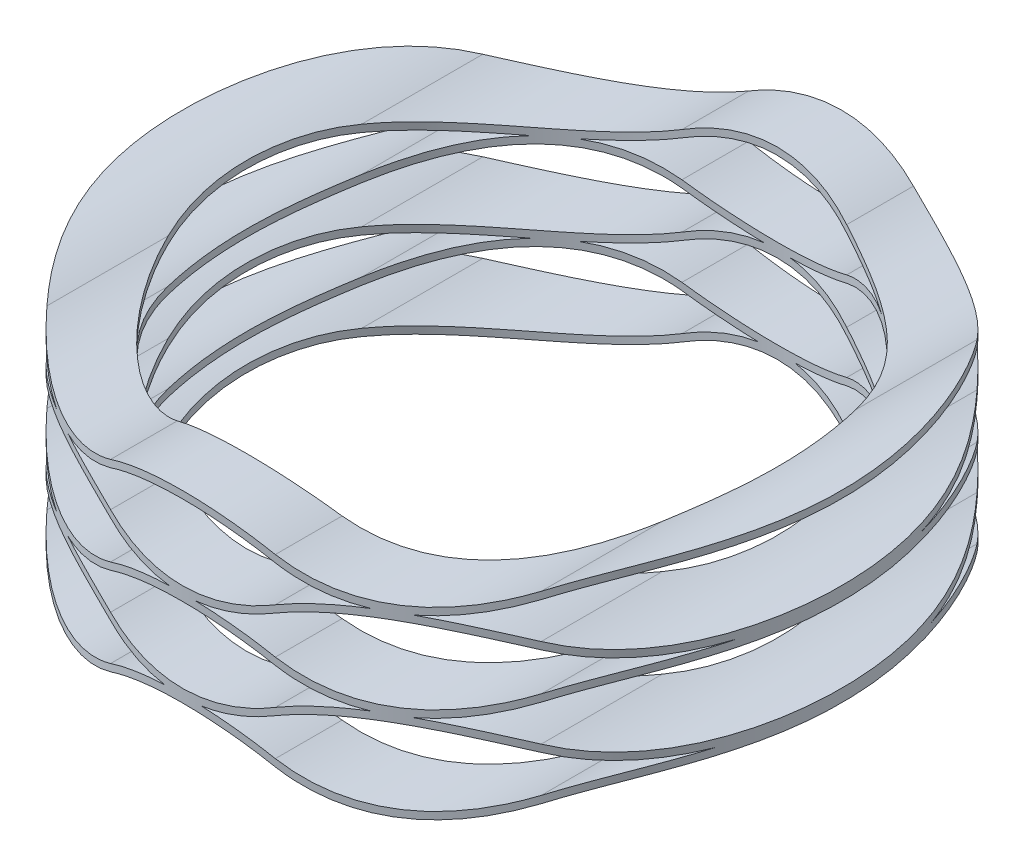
from build123d import *

# Parameters (mm, degrees)
BOSS_EXTRUDE1_DEPTH      = 11.1252
BOSS_EXTRUDE1_DEPTH_BACK = 11.1252
BOSS_EXTRUDE2_DEPTH      = 11.1252
BOSS_EXTRUDE2_DEPTH_BACK = 11.1252
BOSS_EXTRUDE3_DEPTH      = 11.1252
BOSS_EXTRUDE3_DEPTH_BACK = 11.1252
BOSS_EXTRUDE4_DEPTH      = 11.1252
BOSS_EXTRUDE4_DEPTH_BACK = 11.1252
BOSS_EXTRUDE5_DEPTH      = 11.1252
BOSS_EXTRUDE5_DEPTH_BACK = 11.1252
SKETCH6_W                = 37.084
SKETCH6_H                = 37.084
SKETCH6_R                = 9.271
CUT_EXTRUDE1_DEPTH       = 6.2484
SKETCH7_R                = 7.4676
CUT_EXTRUDE2_DEPTH       = 6.2484


with BuildPart() as part:
    # Sketch1 → Boss-Extrude1 (new, two sides: drawn at the far end of the back side and taken through both)
    with BuildSketch(Plane.XY.offset(-BOSS_EXTRUDE1_DEPTH_BACK)):
        with BuildLine():
            Line((11.58875, 0.52324), (11.58875, 0.72644))
            ThreePointArc((11.58875, 0.72644), (9.271, 1.27508), (6.95325, 0.72644))
            ThreePointArc((6.95325, 0.72644), (4.6355, 0.2032), (2.31775, 0.72644))
            ThreePointArc((2.31775, 0.72644), (0, 1.27508), (-2.31775, 0.72644))
            ThreePointArc((-2.31775, 0.72644), (-4.6355, 0.2032), (-6.95325, 0.72644))
            ThreePointArc((-6.95325, 0.72644), (-9.271, 1.27508), (-11.58875, 0.72644))
            Line((-11.58875, 0.72644), (-11.58875, 0.52324))
            ThreePointArc((-11.58875, 0.52324), (-9.271, 1.07188), (-6.95325, 0.52324))
            ThreePointArc((-6.95325, 0.52324), (-4.6355, 0), (-2.31775, 0.52324))
            ThreePointArc((-2.31775, 0.52324), (0, 1.07188), (2.31775, 0.52324))
            ThreePointArc((2.31775, 0.52324), (4.6355, 0), (6.95325, 0.52324))
            ThreePointArc((6.95325, 0.52324), (9.271, 1.07188), (11.58875, 0.52324))
        make_face()
    extrude(amount=BOSS_EXTRUDE1_DEPTH + BOSS_EXTRUDE1_DEPTH_BACK)

    # Sketch2 → Boss-Extrude2 (add, two sides: drawn at the far end of the back side and taken through both)
    with BuildSketch(Plane.XY.offset(-BOSS_EXTRUDE2_DEPTH_BACK)):
        with BuildLine():
            Line((-11.58875, 1.97612), (-11.58875, 1.77292))
            ThreePointArc((-11.58875, 1.77292), (-9.271, 1.22428), (-6.95325, 1.77292))
            ThreePointArc((-6.95325, 1.77292), (-4.6355, 2.29616), (-2.31775, 1.77292))
            ThreePointArc((-2.31775, 1.77292), (0, 1.22428), (2.31775, 1.77292))
            ThreePointArc((2.31775, 1.77292), (4.6355, 2.29616), (6.95325, 1.77292))
            ThreePointArc((6.95325, 1.77292), (9.271, 1.22428), (11.58875, 1.77292))
            Line((11.58875, 1.77292), (11.58875, 1.97612))
            ThreePointArc((11.58875, 1.97612), (9.271, 1.42748), (6.95325, 1.97612))
            ThreePointArc((6.95325, 1.97612), (4.6355, 2.49936), (2.31775, 1.97612))
            ThreePointArc((2.31775, 1.97612), (0, 1.42748), (-2.31775, 1.97612))
            ThreePointArc((-2.31775, 1.97612), (-4.6355, 2.49936), (-6.95325, 1.97612))
            ThreePointArc((-6.95325, 1.97612), (-9.271, 1.42748), (-11.58875, 1.97612))
        make_face()
    extrude(amount=BOSS_EXTRUDE2_DEPTH + BOSS_EXTRUDE2_DEPTH_BACK)

    # Sketch3 → Boss-Extrude3 (add, two sides: drawn at the far end of the back side and taken through both)
    with BuildSketch(Plane.XY.offset(-BOSS_EXTRUDE3_DEPTH_BACK)):
        with BuildLine():
            Line((11.58875, 2.9972), (11.58875, 3.2004))
            ThreePointArc((11.58875, 3.2004), (9.271, 3.74904), (6.95325, 3.2004))
            ThreePointArc((6.95325, 3.2004), (4.6355, 2.67716), (2.31775, 3.2004))
            ThreePointArc((2.31775, 3.2004), (0, 3.74904), (-2.31775, 3.2004))
            ThreePointArc((-2.31775, 3.2004), (-4.6355, 2.67716), (-6.95325, 3.2004))
            ThreePointArc((-6.95325, 3.2004), (-9.271, 3.74904), (-11.58875, 3.2004))
            Line((-11.58875, 3.2004), (-11.58875, 2.9972))
            ThreePointArc((-11.58875, 2.9972), (-9.271, 3.54584), (-6.95325, 2.9972))
            ThreePointArc((-6.95325, 2.9972), (-4.6355, 2.47396), (-2.31775, 2.9972))
            ThreePointArc((-2.31775, 2.9972), (0, 3.54584), (2.31775, 2.9972))
            ThreePointArc((2.31775, 2.9972), (4.6355, 2.47396), (6.95325, 2.9972))
            ThreePointArc((6.95325, 2.9972), (9.271, 3.54584), (11.58875, 2.9972))
        make_face()
    extrude(amount=BOSS_EXTRUDE3_DEPTH + BOSS_EXTRUDE3_DEPTH_BACK)

    # Sketch4 → Boss-Extrude4 (add, two sides: drawn at the far end of the back side and taken through both)
    with BuildSketch(Plane.XY.offset(-BOSS_EXTRUDE4_DEPTH_BACK)):
        with BuildLine():
            Line((-11.58875, 4.47548), (-11.58875, 4.27228))
            ThreePointArc((-11.58875, 4.27228), (-9.271, 3.72364), (-6.95325, 4.27228))
            ThreePointArc((-6.95325, 4.27228), (-4.6355, 4.79552), (-2.31775, 4.27228))
            ThreePointArc((-2.31775, 4.27228), (0, 3.72364), (2.31775, 4.27228))
            ThreePointArc((2.31775, 4.27228), (4.6355, 4.79552), (6.95325, 4.27228))
            ThreePointArc((6.95325, 4.27228), (9.271, 3.72364), (11.58875, 4.27228))
            Line((11.58875, 4.27228), (11.58875, 4.47548))
            ThreePointArc((11.58875, 4.47548), (9.271, 3.92684), (6.95325, 4.47548))
            ThreePointArc((6.95325, 4.47548), (4.6355, 4.99872), (2.31775, 4.47548))
            ThreePointArc((2.31775, 4.47548), (0, 3.92684), (-2.31775, 4.47548))
            ThreePointArc((-2.31775, 4.47548), (-4.6355, 4.99872), (-6.95325, 4.47548))
            ThreePointArc((-6.95325, 4.47548), (-9.271, 3.92684), (-11.58875, 4.47548))
        make_face()
    extrude(amount=BOSS_EXTRUDE4_DEPTH + BOSS_EXTRUDE4_DEPTH_BACK)

    # Sketch5 → Boss-Extrude5 (add, two sides: drawn at the far end of the back side and taken through both)
    with BuildSketch(Plane.XY.offset(-BOSS_EXTRUDE5_DEPTH_BACK)):
        with BuildLine():
            Line((11.58875, 5.49656), (11.58875, 5.69976))
            ThreePointArc((11.58875, 5.69976), (9.271, 6.2484), (6.95325, 5.69976))
            ThreePointArc((6.95325, 5.69976), (4.6355, 5.17652), (2.31775, 5.69976))
            ThreePointArc((2.31775, 5.69976), (0, 6.2484), (-2.31775, 5.69976))
            ThreePointArc((-2.31775, 5.69976), (-4.6355, 5.17652), (-6.95325, 5.69976))
            ThreePointArc((-6.95325, 5.69976), (-9.271, 6.2484), (-11.58875, 5.69976))
            Line((-11.58875, 5.69976), (-11.58875, 5.49656))
            ThreePointArc((-11.58875, 5.49656), (-9.271, 6.0452), (-6.95325, 5.49656))
            ThreePointArc((-6.95325, 5.49656), (-4.6355, 4.97332), (-2.31775, 5.49656))
            ThreePointArc((-2.31775, 5.49656), (0, 6.0452), (2.31775, 5.49656))
            ThreePointArc((2.31775, 5.49656), (4.6355, 4.97332), (6.95325, 5.49656))
            ThreePointArc((6.95325, 5.49656), (9.271, 6.0452), (11.58875, 5.49656))
        make_face()
    extrude(amount=BOSS_EXTRUDE5_DEPTH + BOSS_EXTRUDE5_DEPTH_BACK)

    # Sketch6 → Cut-Extrude1 (cut)
    with BuildSketch(Plane(origin=(0, 0, 0), x_dir=(1, 0, 0), z_dir=(0, 1, 0))):
        Rectangle(SKETCH6_W, SKETCH6_H)
        with Locations(Location((0, 0, 0), (0, 0, 104.477512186))):
            Circle(SKETCH6_R, mode=Mode.SUBTRACT)
    extrude(amount=CUT_EXTRUDE1_DEPTH, mode=Mode.SUBTRACT)

    # Sketch7 → Cut-Extrude2 (cut)
    with BuildSketch(Plane(origin=(0, 0, 0), x_dir=(1, 0, 0), z_dir=(0, 1, 0))):
        with Locations(Location((0, 0, 0), (0, 0, 71.918220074))):
            Circle(SKETCH7_R)
    extrude(amount=CUT_EXTRUDE2_DEPTH, mode=Mode.SUBTRACT)


solid = part.part
